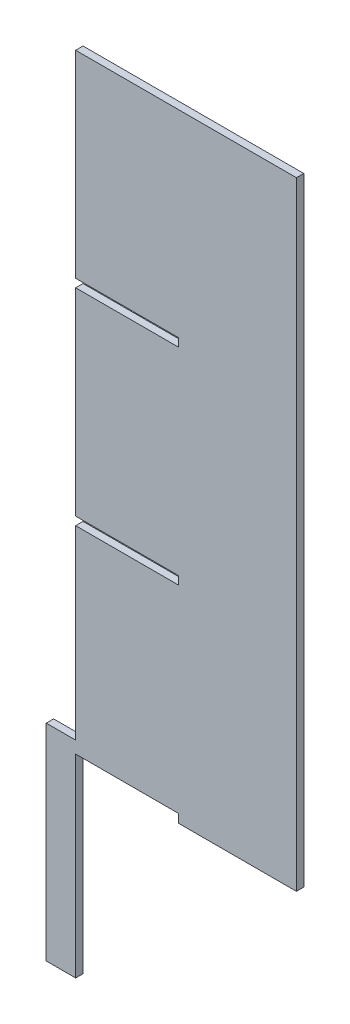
from build123d import *

# Parameters (mm, degrees)
BOSS_EXTRUDE1_DEPTH = 2.5


with BuildPart() as part:
    # Sketch1 → Boss-Extrude1 (new body)
    with BuildSketch(Plane.XY):
        Polygon((24.501036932, -1.5), (64.501036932, -1.5), (64.501036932, 208.5), (-10.498963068, 208.5), (-10.498963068, 141.4), (24.501036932, 141.4), (24.501036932, 138.6), (-10.498963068, 138.6), (-10.498963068, 71.4), (24.501036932, 71.4), (24.501036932, 68.6), (-10.498963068, 68.6), (-10.498963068, 5.501442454), (-20.498963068, 5.501442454), (-20.498963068, -64.498557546), (-10.498963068, -64.498557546), (-10.498963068, 1.4), (24.501036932, 1.4), align=None)
    extrude(amount=BOSS_EXTRUDE1_DEPTH)


solid = part.part
